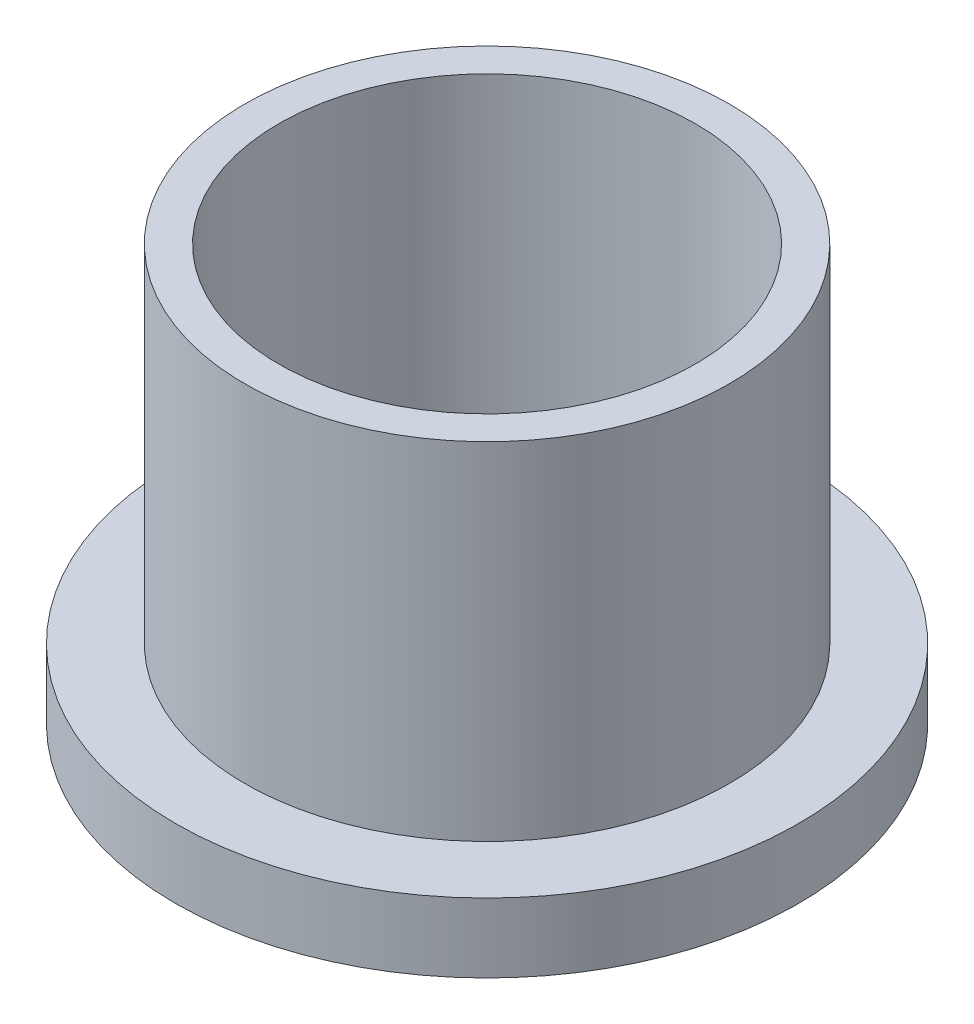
from build123d import *

# Parameters (mm, degrees)
SKETCH2_R           = 11.1125
SKETCH2_R_2         = 9.5504
BOSS_EXTRUDE1_DEPTH = 19.05
SKETCH3_R           = 14.2875
SKETCH3_R_2         = 11.1125
BOSS_EXTRUDE2_DEPTH = 3.175


with BuildPart() as part:
    # Sketch2 → Boss-Extrude1 (new body)
    with BuildSketch(Plane(origin=(0, 0, 0), x_dir=(1, 0, 0), z_dir=(0, 1, 0))):
        with Locations(Location((0, 0, 0), (0, 0, 90))):
            Circle(SKETCH2_R)
        with Locations(Location((0, 0, 0), (0, 0, 90))):
            Circle(SKETCH2_R_2, mode=Mode.SUBTRACT)
    extrude(amount=BOSS_EXTRUDE1_DEPTH)

    # Sketch3 → Boss-Extrude2 (add)
    with BuildSketch(Plane(origin=(0, 0, 0), x_dir=(1, 0, 0), z_dir=(0, 1, 0))):
        with Locations(Location((0, 0, 0), (0, 0, 270))):
            Circle(SKETCH3_R)
        with Locations(Location((0, 0, 0), (0, 0, 90))):
            Circle(SKETCH3_R_2, mode=Mode.SUBTRACT)
    extrude(amount=BOSS_EXTRUDE2_DEPTH)


solid = part.part
